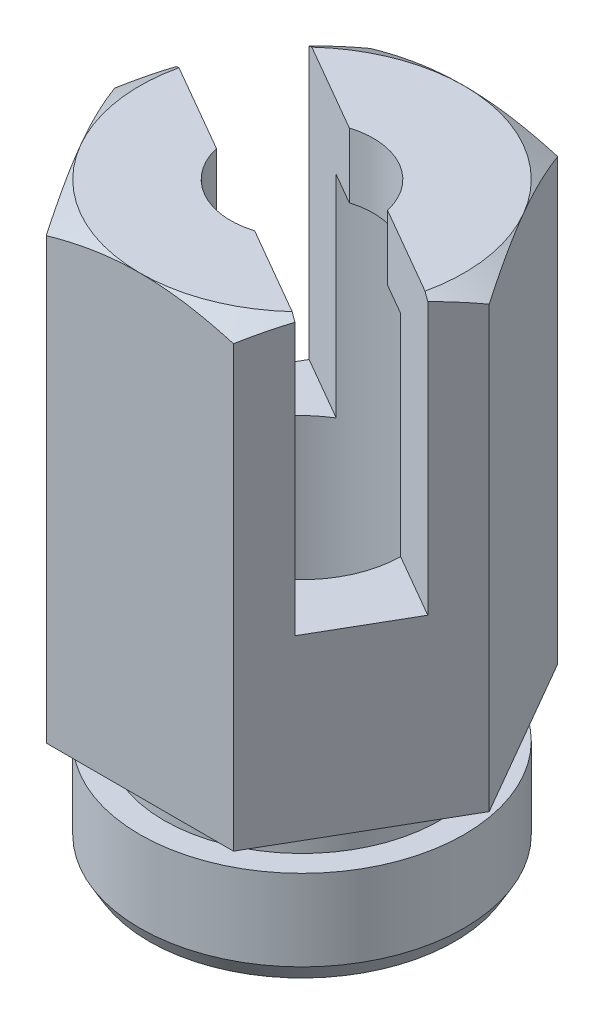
ISO-10303-21;
HEADER;
FILE_DESCRIPTION(('STEP AP214'),'2;1');
FILE_NAME('part.step','',(''),(''),'','','');
FILE_SCHEMA(('AUTOMOTIVE_DESIGN { 1 0 10303 214 1 1 1 1 }'));
ENDSEC;
DATA;
#1=APPLICATION_CONTEXT('core data for automotive mechanical design processes');
#2=APPLICATION_PROTOCOL_DEFINITION('international standard','automotive_design',2000,#1);
#3=PRODUCT_CONTEXT('',#1,'mechanical');
#4=PRODUCT('Part','Part','',(#3));
#5=PRODUCT_RELATED_PRODUCT_CATEGORY('part','',(#4));
#6=PRODUCT_DEFINITION_FORMATION('','',#4);
#7=PRODUCT_DEFINITION_CONTEXT('part definition',#1,'design');
#8=PRODUCT_DEFINITION('design','',#6,#7);
#9=PRODUCT_DEFINITION_SHAPE('','',#8);
#10=(LENGTH_UNIT() NAMED_UNIT(*) SI_UNIT(.MILLI.,.METRE.));
#11=(NAMED_UNIT(*) PLANE_ANGLE_UNIT() SI_UNIT($,.RADIAN.));
#12=(NAMED_UNIT(*) SI_UNIT($,.STERADIAN.) SOLID_ANGLE_UNIT());
#13=UNCERTAINTY_MEASURE_WITH_UNIT(LENGTH_MEASURE(1.E-05),#10,'distance_accuracy_value','');
#14=(GEOMETRIC_REPRESENTATION_CONTEXT(3) GLOBAL_UNCERTAINTY_ASSIGNED_CONTEXT((#13)) GLOBAL_UNIT_ASSIGNED_CONTEXT((#10,
#11,#12)) REPRESENTATION_CONTEXT('',''));
#15=CARTESIAN_POINT('',(0.,0.,0.));
#16=DIRECTION('',(0.,0.,1.));
#17=DIRECTION('',(1.,0.,0.));
#18=AXIS2_PLACEMENT_3D('',#15,#16,#17);
#19=CARTESIAN_POINT('',(-7.24519052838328,14.,-2.45096189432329));
#20=DIRECTION('',(-0.499999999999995,0.,0.866025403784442));
#21=DIRECTION('',(0.866025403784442,0.,0.499999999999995));
#22=AXIS2_PLACEMENT_3D('',#19,#20,#21);
#23=PLANE('',#22);
#24=DIRECTION('',(-0.866025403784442,0.,-0.499999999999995));
#25=VECTOR('',#24,1.);
#26=CARTESIAN_POINT('',(-0.749999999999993,12.,1.29903810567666));
#27=LINE('',#26,#25);
#28=CARTESIAN_POINT('',(1.59946802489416,12.,2.6555041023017));
#29=VERTEX_POINT('',#28);
#30=CARTESIAN_POINT('',(0.643735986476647,12.,2.10371195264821));
#31=VERTEX_POINT('',#30);
#32=EDGE_CURVE('E197',#29,#31,#27,.T.);
#33=ORIENTED_EDGE('',*,*,#32,.T.);
#34=DIRECTION('',(0.,1.,0.));
#35=VECTOR('',#34,1.);
#36=CARTESIAN_POINT('',(0.643735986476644,-4.,2.10371195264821));
#37=LINE('',#36,#35);
#38=CARTESIAN_POINT('',(0.643735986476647,14.,2.10371195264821));
#39=VERTEX_POINT('',#38);
#40=EDGE_CURVE('E184',#31,#39,#37,.T.);
#41=ORIENTED_EDGE('',*,*,#40,.T.);
#42=DIRECTION('',(0.866025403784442,0.,0.499999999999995));
#43=VECTOR('',#42,1.);
#44=CARTESIAN_POINT('',(-7.24519052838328,14.,-2.45096189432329));
#45=LINE('',#44,#43);
#46=CARTESIAN_POINT('',(3.38067791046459,14.,3.683886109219));
#47=VERTEX_POINT('',#46);
#48=EDGE_CURVE('E194',#39,#47,#45,.T.);
#49=ORIENTED_EDGE('',*,*,#48,.T.);
#50=CARTESIAN_POINT('',(-2.34730853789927,15.5141796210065,0.376831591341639));
#51=CARTESIAN_POINT('',(-2.30079289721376,15.5382316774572,0.403687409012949));
#52=CARTESIAN_POINT('',(-2.25414428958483,15.5619468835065,0.430619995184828));
#53=CARTESIAN_POINT('',(-2.16052429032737,15.608541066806,0.484671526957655));
#54=CARTESIAN_POINT('',(-2.11355283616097,15.6314198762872,0.511790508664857));
#55=CARTESIAN_POINT('',(-2.01903264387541,15.6762715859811,0.566361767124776));
#56=CARTESIAN_POINT('',(-1.97148224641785,15.6982398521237,0.593815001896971));
#57=CARTESIAN_POINT('',(-1.87596681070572,15.7409280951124,0.648960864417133));
#58=CARTESIAN_POINT('',(-1.82800179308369,15.7616481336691,0.6766534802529));
#59=CARTESIAN_POINT('',(-1.6834764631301,15.8215133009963,0.760095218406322));
#60=CARTESIAN_POINT('',(-1.58619769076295,15.8584063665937,0.81625914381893));
#61=CARTESIAN_POINT('',(-1.38948829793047,15.9231515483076,0.929829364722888));
#62=CARTESIAN_POINT('',(-1.29006155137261,15.951018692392,0.987233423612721));
#63=CARTESIAN_POINT('',(-1.11626093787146,15.9881510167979,1.08757725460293));
#64=CARTESIAN_POINT('',(-1.04237740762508,16.000408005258,1.13023393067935));
#65=CARTESIAN_POINT('',(-0.893933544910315,16.0167895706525,1.21593803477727));
#66=CARTESIAN_POINT('',(-0.819373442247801,16.0209168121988,1.25898533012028));
#67=CARTESIAN_POINT('',(-0.670746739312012,16.0205225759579,1.34479499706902));
#68=CARTESIAN_POINT('',(-0.596680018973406,16.0160559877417,1.38755743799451));
#69=CARTESIAN_POINT('',(-0.449238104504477,15.9991406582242,1.47268306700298));
#70=CARTESIAN_POINT('',(-0.375863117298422,15.9866896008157,1.51504613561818));
#71=CARTESIAN_POINT('',(-0.224432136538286,15.9538511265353,1.60247485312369));
#72=CARTESIAN_POINT('',(-0.146468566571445,15.9329107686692,1.64748714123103));
#73=CARTESIAN_POINT('',(0.0080872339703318,15.8850862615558,1.73671997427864));
#74=CARTESIAN_POINT('',(0.0846787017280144,15.858198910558,1.78094007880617));
#75=CARTESIAN_POINT('',(0.236793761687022,15.7999880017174,1.8687637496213));
#76=CARTESIAN_POINT('',(0.312313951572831,15.768652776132,1.91236535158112));
#77=CARTESIAN_POINT('',(0.462273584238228,15.7027978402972,1.99894458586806));
#78=CARTESIAN_POINT('',(0.536713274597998,15.6682788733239,2.04192236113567));
#79=CARTESIAN_POINT('',(0.686870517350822,15.5958718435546,2.12861568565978));
#80=CARTESIAN_POINT('',(0.76256316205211,15.5579153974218,2.17231685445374));
#81=CARTESIAN_POINT('',(0.913236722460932,15.4801649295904,2.25930827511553));
#82=CARTESIAN_POINT('',(0.988217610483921,15.4403708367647,2.30259851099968));
#83=CARTESIAN_POINT('',(1.21206798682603,15.3190780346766,2.431838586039));
#84=CARTESIAN_POINT('',(1.36010571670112,15.2355390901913,2.5173082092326));
#85=CARTESIAN_POINT('',(1.70424594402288,15.0366807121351,2.7159976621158));
#86=CARTESIAN_POINT('',(1.89979912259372,14.920107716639,2.82890034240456));
#87=CARTESIAN_POINT('',(2.2894681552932,14.6837820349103,3.05387586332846));
#88=CARTESIAN_POINT('',(2.48358390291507,14.5640291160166,3.16594864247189));
#89=CARTESIAN_POINT('',(2.87106534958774,14.322474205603,3.38966116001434));
#90=CARTESIAN_POINT('',(3.06443027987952,14.2006705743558,3.50130045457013));
#91=CARTESIAN_POINT('',(3.45054915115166,13.9557986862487,3.72422628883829));
#92=CARTESIAN_POINT('',(3.6433031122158,13.8327304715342,3.83551284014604));
#93=CARTESIAN_POINT('',(4.01073159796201,13.5970499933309,4.04764777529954));
#94=CARTESIAN_POINT('',(4.18544285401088,13.4845140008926,4.14851736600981));
#95=CARTESIAN_POINT('',(4.53461020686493,13.2589109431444,4.35010923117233));
#96=CARTESIAN_POINT('',(4.7090663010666,13.1458438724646,4.45083150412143));
#97=CARTESIAN_POINT('',(5.05759484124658,12.9194336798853,4.65205455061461));
#98=CARTESIAN_POINT('',(5.23166749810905,12.8060909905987,4.75255544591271));
#99=CARTESIAN_POINT('',(5.57965734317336,12.579093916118,4.95346747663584));
#100=CARTESIAN_POINT('',(5.75357453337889,12.4654395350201,5.05387861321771));
#101=CARTESIAN_POINT('',(5.92743555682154,12.3516710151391,5.1542573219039));
#102=B_SPLINE_CURVE_WITH_KNOTS('',3,(#50,#51,#52,#53,#54,#55,#56,#57,#58,#59,#60,#61,#62,#63,
#64,#65,#66,#67,#68,#69,#70,#71,#72,#73,#74,#75,#76,#77,#78,#79,#80,#81,#82,#83,#84,#85,#86,#87,
#88,#89,#90,#91,#92,#93,#94,#95,#96,#97,#98,#99,#100,#101),.UNSPECIFIED.,.F.,.F.,(4,2,2,2,2,2,2,
2,2,2,2,2,2,2,2,2,2,2,2,2,2,2,2,2,2,4),(0.,0.176555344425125,0.35314591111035,0.530546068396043,
0.707937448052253,1.06238910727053,1.41624754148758,1.67448512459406,1.932638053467,
2.18914760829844,2.4457316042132,2.72274393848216,2.99990577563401,3.27780858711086,
3.55564668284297,3.84148345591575,4.12733130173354,4.69804471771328,5.46036469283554,
6.22274059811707,6.98575813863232,7.74875033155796,8.44176262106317,9.13478193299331,
9.82704932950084,10.5193076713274),.UNSPECIFIED.);
#103=CARTESIAN_POINT('',(3.58012701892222,13.8728944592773,3.79903810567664));
#104=VERTEX_POINT('',#103);
#105=EDGE_CURVE('E266',#47,#104,#102,.T.);
#106=ORIENTED_EDGE('',*,*,#105,.T.);
#107=DIRECTION('',(0.,-1.,0.));
#108=VECTOR('',#107,1.);
#109=CARTESIAN_POINT('',(3.58012701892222,14.,3.79903810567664));
#110=LINE('',#109,#108);
#111=CARTESIAN_POINT('',(3.58012701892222,5.5,3.79903810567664));
#112=VERTEX_POINT('',#111);
#113=EDGE_CURVE('E198',#104,#112,#110,.T.);
#114=ORIENTED_EDGE('',*,*,#113,.T.);
#115=DIRECTION('',(0.866025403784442,0.,0.499999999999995));
#116=VECTOR('',#115,1.);
#117=CARTESIAN_POINT('',(-7.24519052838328,5.5,-2.45096189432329));
#118=LINE('',#117,#116);
#119=CARTESIAN_POINT('',(1.59946802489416,5.5,2.6555041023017));
#120=VERTEX_POINT('',#119);
#121=EDGE_CURVE('E219',#120,#112,#118,.T.);
#122=ORIENTED_EDGE('',*,*,#121,.F.);
#123=DIRECTION('',(0.,-1.,0.));
#124=VECTOR('',#123,1.);
#125=CARTESIAN_POINT('',(1.59946802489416,12.,2.6555041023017));
#126=LINE('',#125,#124);
#127=EDGE_CURVE('E492',#29,#120,#126,.T.);
#128=ORIENTED_EDGE('',*,*,#127,.F.);
#129=EDGE_LOOP('',(#33,#41,#49,#106,#114,#122,#128));
#130=FACE_BOUND('',#129,.T.);
#131=ADVANCED_FACE('F34',(#130),#23,.F.);
#132=CARTESIAN_POINT('',(-5.7451905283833,14.,-5.04903810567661));
#133=DIRECTION('',(0.499999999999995,0.,-0.866025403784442));
#134=DIRECTION('',(-0.866025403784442,0.,-0.499999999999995));
#135=AXIS2_PLACEMENT_3D('',#132,#133,#134);
#136=PLANE('',#135);
#137=DIRECTION('',(0.866025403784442,0.,0.499999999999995));
#138=VECTOR('',#137,1.);
#139=CARTESIAN_POINT('',(0.749999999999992,12.,-1.29903810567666));
#140=LINE('',#139,#138);
#141=CARTESIAN_POINT('',(-1.59946802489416,12.,-2.6555041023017));
#142=VERTEX_POINT('',#141);
#143=CARTESIAN_POINT('',(-0.643735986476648,12.,-2.10371195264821));
#144=VERTEX_POINT('',#143);
#145=EDGE_CURVE('E387',#142,#144,#140,.T.);
#146=ORIENTED_EDGE('',*,*,#145,.T.);
#147=DIRECTION('',(0.,1.,0.));
#148=VECTOR('',#147,1.);
#149=CARTESIAN_POINT('',(-0.643735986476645,-4.,-2.10371195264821));
#150=LINE('',#149,#148);
#151=CARTESIAN_POINT('',(-0.643735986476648,14.,-2.10371195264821));
#152=VERTEX_POINT('',#151);
#153=EDGE_CURVE('E11',#144,#152,#150,.T.);
#154=ORIENTED_EDGE('',*,*,#153,.T.);
#155=DIRECTION('',(0.866025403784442,0.,0.499999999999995));
#156=VECTOR('',#155,1.);
#157=CARTESIAN_POINT('',(-5.7451905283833,14.,-5.04903810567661));
#158=LINE('',#157,#156);
#159=CARTESIAN_POINT('',(-3.38067791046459,14.,-3.683886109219));
#160=VERTEX_POINT('',#159);
#161=EDGE_CURVE('E205',#160,#152,#158,.T.);
#162=ORIENTED_EDGE('',*,*,#161,.F.);
#163=CARTESIAN_POINT('',(3.04768865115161,15.1270956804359,0.0275330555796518));
#164=CARTESIAN_POINT('',(2.99306879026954,15.1587903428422,-0.00400173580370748));
#165=CARTESIAN_POINT('',(2.93835579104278,15.1902722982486,-0.035590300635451));
#166=CARTESIAN_POINT('',(2.82870393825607,15.2527116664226,-0.0988978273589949));
#167=CARTESIAN_POINT('',(2.77376507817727,15.2836690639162,-0.130616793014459));
#168=CARTESIAN_POINT('',(2.60834286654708,15.3757210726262,-0.226123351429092));
#169=CARTESIAN_POINT('',(2.49746409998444,15.4358725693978,-0.29013923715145));
#170=CARTESIAN_POINT('',(2.26860115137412,15.5553716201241,-0.422273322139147));
#171=CARTESIAN_POINT('',(2.15054011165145,15.6145265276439,-0.490435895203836));
#172=CARTESIAN_POINT('',(1.97171271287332,15.6982307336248,-0.593681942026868));
#173=CARTESIAN_POINT('',(1.9118303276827,15.7252876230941,-0.628255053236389));
#174=CARTESIAN_POINT('',(1.79136699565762,15.7772310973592,-0.697804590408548));
#175=CARTESIAN_POINT('',(1.73078612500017,15.8021179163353,-0.732780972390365));
#176=CARTESIAN_POINT('',(1.59527764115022,15.8543233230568,-0.811016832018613));
#177=CARTESIAN_POINT('',(1.52014852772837,15.8809567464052,-0.854392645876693));
#178=CARTESIAN_POINT('',(1.36857820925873,15.9285860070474,-0.941901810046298));
#179=CARTESIAN_POINT('',(1.29213779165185,15.9495851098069,-0.986034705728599));
#180=CARTESIAN_POINT('',(1.1393827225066,15.9839021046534,-1.07422788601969));
#181=CARTESIAN_POINT('',(1.06309121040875,15.9973531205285,-1.11827481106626));
#182=CARTESIAN_POINT('',(0.909737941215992,16.0156487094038,-1.20681336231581));
#183=CARTESIAN_POINT('',(0.832676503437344,16.0204967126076,-1.25130480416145));
#184=CARTESIAN_POINT('',(0.67774607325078,16.0209413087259,-1.34075392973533));
#185=CARTESIAN_POINT('',(0.599876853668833,16.0164431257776,-1.38571174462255));
#186=CARTESIAN_POINT('',(0.44490398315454,15.9986228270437,-1.47518537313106));
#187=CARTESIAN_POINT('',(0.367800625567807,15.9852974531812,-1.51970101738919));
#188=CARTESIAN_POINT('',(0.213864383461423,15.9511377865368,-1.60857614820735));
#189=CARTESIAN_POINT('',(0.13704755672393,15.9302096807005,-1.65292636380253));
#190=CARTESIAN_POINT('',(0.0228556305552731,15.894535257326,-1.71885510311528));
#191=CARTESIAN_POINT('',(-0.0150397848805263,15.881928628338,-1.7407340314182));
#192=CARTESIAN_POINT('',(-0.0905047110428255,15.855480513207,-1.78430372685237));
#193=CARTESIAN_POINT('',(-0.128074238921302,15.8416390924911,-1.80599450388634));
#194=CARTESIAN_POINT('',(-0.241837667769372,15.7979525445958,-1.87167585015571));
#195=CARTESIAN_POINT('',(-0.317550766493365,15.7664392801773,-1.91538882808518));
#196=CARTESIAN_POINT('',(-0.467929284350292,15.7002215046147,-2.00220990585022));
#197=CARTESIAN_POINT('',(-0.542594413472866,15.6655161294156,-2.04531783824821));
#198=CARTESIAN_POINT('',(-0.691135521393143,15.5937356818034,-2.13107808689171));
#199=CARTESIAN_POINT('',(-0.765010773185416,15.5566586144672,-2.17372998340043));
#200=CARTESIAN_POINT('',(-0.912085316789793,15.4807528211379,-2.25864351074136));
#201=CARTESIAN_POINT('',(-0.985284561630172,15.4419239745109,-2.30090511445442));
#202=CARTESIAN_POINT('',(-1.20445907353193,15.3232708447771,-2.42744557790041));
#203=CARTESIAN_POINT('',(-1.34962973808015,15.2414699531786,-2.51125990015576));
#204=CARTESIAN_POINT('',(-1.6385223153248,15.0747692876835,-2.67805210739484));
#205=CARTESIAN_POINT('',(-1.78224492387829,14.9898711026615,-2.76103039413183));
#206=CARTESIAN_POINT('',(-2.06914226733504,14.8178140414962,-2.92667065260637));
#207=CARTESIAN_POINT('',(-2.21231462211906,14.7306498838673,-3.00933125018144));
#208=CARTESIAN_POINT('',(-2.49803425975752,14.5549216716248,-3.17429155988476));
#209=CARTESIAN_POINT('',(-2.64058146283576,14.4663574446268,-3.25659122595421));
#210=CARTESIAN_POINT('',(-3.06708652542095,14.199505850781,-3.50283403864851));
#211=CARTESIAN_POINT('',(-3.35036826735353,14.0197795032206,-3.66638682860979));
#212=CARTESIAN_POINT('',(-3.94797673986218,13.637776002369,-4.01141624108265));
#213=CARTESIAN_POINT('',(-4.26218414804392,13.4352511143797,-4.19282397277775));
#214=CARTESIAN_POINT('',(-4.89004132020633,13.0285956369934,-4.55531748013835));
#215=CARTESIAN_POINT('',(-5.20369069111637,12.8244642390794,-4.73640302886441));
#216=CARTESIAN_POINT('',(-5.82767333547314,12.4171353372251,-5.09665957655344));
#217=CARTESIAN_POINT('',(-6.13801075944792,12.2139463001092,-5.2758329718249));
#218=CARTESIAN_POINT('',(-6.75820026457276,11.8070435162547,-5.6338995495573));
#219=CARTESIAN_POINT('',(-7.06805251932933,11.60333012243,-5.81279283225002));
#220=CARTESIAN_POINT('',(-7.37781567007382,11.3994371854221,-5.99163467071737));
#221=B_SPLINE_CURVE_WITH_KNOTS('',3,(#163,#164,#165,#166,#167,#168,#169,#170,#171,#172,#173,
#174,#175,#176,#177,#178,#179,#180,#181,#182,#183,#184,#185,#186,#187,#188,#189,#190,#191,#192,
#193,#194,#195,#196,#197,#198,#199,#200,#201,#202,#203,#204,#205,#206,#207,#208,#209,#210,#211,
#212,#213,#214,#215,#216,#217,#218,#219,#220),.UNSPECIFIED.,.F.,.F.,(4,2,2,2,2,2,2,2,2,2,2,2,2,
2,2,2,2,2,2,2,2,2,2,2,2,2,2,2,4),(0.,0.211757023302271,0.423520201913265,0.847862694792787,
1.29355081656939,1.51627718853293,1.73897949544,2.01108280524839,2.2830280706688,
2.55001286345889,2.81689117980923,3.08648900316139,3.35618638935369,3.62933146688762,
3.76593075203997,3.90252280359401,4.18122223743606,4.45999733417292,4.73901008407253,
5.01804207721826,5.57754413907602,6.13676311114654,6.69742917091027,7.25816480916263,
8.37783348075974,9.62436949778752,10.8715790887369,12.1074117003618,13.3425598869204),.UNSPECIFIED.);
#222=CARTESIAN_POINT('',(-3.58012701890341,13.8728944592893,-3.79903810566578));
#223=VERTEX_POINT('',#222);
#224=EDGE_CURVE('E234',#160,#223,#221,.T.);
#225=ORIENTED_EDGE('',*,*,#224,.T.);
#226=DIRECTION('',(0.,1.,0.));
#227=VECTOR('',#226,1.);
#228=CARTESIAN_POINT('',(-3.5801270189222,14.,-3.79903810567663));
#229=LINE('',#228,#227);
#230=CARTESIAN_POINT('',(-3.5801270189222,5.5,-3.79903810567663));
#231=VERTEX_POINT('',#230);
#232=EDGE_CURVE('E414',#231,#223,#229,.T.);
#233=ORIENTED_EDGE('',*,*,#232,.F.);
#234=DIRECTION('',(0.866025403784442,0.,0.499999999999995));
#235=VECTOR('',#234,1.);
#236=CARTESIAN_POINT('',(-5.7451905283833,5.5,-5.04903810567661));
#237=LINE('',#236,#235);
#238=CARTESIAN_POINT('',(-1.59946802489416,5.5,-2.6555041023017));
#239=VERTEX_POINT('',#238);
#240=EDGE_CURVE('E217',#231,#239,#237,.T.);
#241=ORIENTED_EDGE('',*,*,#240,.T.);
#242=DIRECTION('',(0.,-1.,0.));
#243=VECTOR('',#242,1.);
#244=CARTESIAN_POINT('',(-1.59946802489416,12.,-2.6555041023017));
#245=LINE('',#244,#243);
#246=EDGE_CURVE('E207',#142,#239,#245,.T.);
#247=ORIENTED_EDGE('',*,*,#246,.F.);
#248=EDGE_LOOP('',(#146,#154,#162,#225,#233,#241,#247));
#249=FACE_BOUND('',#248,.T.);
#250=ADVANCED_FACE('F251',(#249),#136,.F.);
#251=CARTESIAN_POINT('',(0.,14.,0.));
#252=DIRECTION('',(0.,1.,0.));
#253=DIRECTION('',(0.,0.,1.));
#254=AXIS2_PLACEMENT_3D('',#251,#252,#253);
#255=PLANE('',#254);
#256=CARTESIAN_POINT('',(0.,14.,0.));
#257=DIRECTION('',(0.,1.,0.));
#258=DIRECTION('',(0.,0.,1.));
#259=AXIS2_PLACEMENT_3D('',#256,#257,#258);
#260=CIRCLE('',#259,2.2);
#261=CARTESIAN_POINT('',(-2.14373598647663,14.,0.494364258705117));
#262=VERTEX_POINT('',#261);
#263=EDGE_CURVE('E181',#262,#39,#260,.T.);
#264=ORIENTED_EDGE('',*,*,#263,.F.);
#265=CARTESIAN_POINT('',(-4.88067791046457,14.,-1.08580989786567));
#266=VERTEX_POINT('',#265);
#267=EDGE_CURVE('E204',#266,#262,#45,.T.);
#268=ORIENTED_EDGE('',*,*,#267,.F.);
#269=CARTESIAN_POINT('',(0.,14.,0.));
#270=DIRECTION('',(0.,1.,0.));
#271=DIRECTION('',(0.,0.,1.));
#272=AXIS2_PLACEMENT_3D('',#269,#270,#271);
#273=CIRCLE('',#272,4.99999999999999);
#274=CARTESIAN_POINT('',(-4.33012701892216,14.,2.50000000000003));
#275=VERTEX_POINT('',#274);
#276=EDGE_CURVE('E431',#266,#275,#273,.T.);
#277=ORIENTED_EDGE('',*,*,#276,.T.);
#278=CARTESIAN_POINT('',(0.,14.,4.99999999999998));
#279=VERTEX_POINT('',#278);
#280=EDGE_CURVE('E436',#275,#279,#273,.T.);
#281=ORIENTED_EDGE('',*,*,#280,.T.);
#282=CARTESIAN_POINT('',(0.,14.,0.));
#283=DIRECTION('',(0.,1.,0.));
#284=DIRECTION('',(0.,0.,1.));
#285=AXIS2_PLACEMENT_3D('',#282,#283,#284);
#286=CIRCLE('',#285,4.99999999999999);
#287=EDGE_CURVE('E203',#279,#47,#286,.T.);
#288=ORIENTED_EDGE('',*,*,#287,.T.);
#289=ORIENTED_EDGE('',*,*,#48,.F.);
#290=EDGE_LOOP('',(#264,#268,#277,#281,#288,#289));
#291=FACE_BOUND('',#290,.T.);
#292=ADVANCED_FACE('F201',(#291),#255,.T.);
#293=CARTESIAN_POINT('',(0.,12.,0.));
#294=DIRECTION('',(0.,-1.,0.));
#295=DIRECTION('',(0.,0.,-1.));
#296=AXIS2_PLACEMENT_3D('',#293,#294,#295);
#297=PLANE('',#296);
#298=CARTESIAN_POINT('',(0.,12.,0.));
#299=DIRECTION('',(0.,-1.,0.));
#300=DIRECTION('',(0.,0.,-1.));
#301=AXIS2_PLACEMENT_3D('',#298,#299,#300);
#302=CIRCLE('',#301,2.2);
#303=CARTESIAN_POINT('',(-2.14373598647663,12.,0.494364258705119));
#304=VERTEX_POINT('',#303);
#305=EDGE_CURVE('E49',#31,#304,#302,.T.);
#306=ORIENTED_EDGE('',*,*,#305,.F.);
#307=ORIENTED_EDGE('',*,*,#32,.F.);
#308=CARTESIAN_POINT('',(0.,12.,0.));
#309=DIRECTION('',(0.,-1.,0.));
#310=DIRECTION('',(0.,0.,-1.));
#311=AXIS2_PLACEMENT_3D('',#308,#309,#310);
#312=CIRCLE('',#311,3.1);
#313=CARTESIAN_POINT('',(-3.09946802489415,12.,-0.0574278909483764));
#314=VERTEX_POINT('',#313);
#315=EDGE_CURVE('E286',#29,#314,#312,.T.);
#316=ORIENTED_EDGE('',*,*,#315,.T.);
#317=EDGE_CURVE('E391',#304,#314,#27,.T.);
#318=ORIENTED_EDGE('',*,*,#317,.F.);
#319=EDGE_LOOP('',(#306,#307,#316,#318));
#320=FACE_BOUND('',#319,.T.);
#321=ADVANCED_FACE('F383',(#320),#297,.T.);
#322=CARTESIAN_POINT('',(0.,0.,0.));
#323=DIRECTION('',(0.,1.,0.));
#324=DIRECTION('',(0.,0.,1.));
#325=AXIS2_PLACEMENT_3D('',#322,#323,#324);
#326=PLANE('',#325);
#327=DIRECTION('',(0.499999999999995,0.,-0.866025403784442));
#328=VECTOR('',#327,1.);
#329=CARTESIAN_POINT('',(2.88675134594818,0.,4.99999999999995));
#330=LINE('',#329,#328);
#331=CARTESIAN_POINT('',(2.88675134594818,0.,4.99999999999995));
#332=VERTEX_POINT('',#331);
#333=CARTESIAN_POINT('',(5.77350269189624,0.,0.));
#334=VERTEX_POINT('',#333);
#335=EDGE_CURVE('E471',#332,#334,#330,.T.);
#336=ORIENTED_EDGE('',*,*,#335,.F.);
#337=DIRECTION('',(1.,0.,0.));
#338=VECTOR('',#337,1.);
#339=CARTESIAN_POINT('',(-2.88675134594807,0.,5.00000000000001));
#340=LINE('',#339,#338);
#341=CARTESIAN_POINT('',(-2.88675134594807,0.,5.00000000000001));
#342=VERTEX_POINT('',#341);
#343=EDGE_CURVE('E458',#342,#332,#340,.T.);
#344=ORIENTED_EDGE('',*,*,#343,.F.);
#345=DIRECTION('',(0.500000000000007,0.,0.866025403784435));
#346=VECTOR('',#345,1.);
#347=CARTESIAN_POINT('',(-5.77350269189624,0.,0.));
#348=LINE('',#347,#346);
#349=CARTESIAN_POINT('',(-5.77350269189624,0.,0.));
#350=VERTEX_POINT('',#349);
#351=EDGE_CURVE('E461',#350,#342,#348,.T.);
#352=ORIENTED_EDGE('',*,*,#351,.F.);
#353=DIRECTION('',(-0.499999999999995,0.,0.866025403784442));
#354=VECTOR('',#353,1.);
#355=CARTESIAN_POINT('',(-2.88675134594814,0.,-4.99999999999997));
#356=LINE('',#355,#354);
#357=CARTESIAN_POINT('',(-2.88675134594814,0.,-4.99999999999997));
#358=VERTEX_POINT('',#357);
#359=EDGE_CURVE('E464',#358,#350,#356,.T.);
#360=ORIENTED_EDGE('',*,*,#359,.F.);
#361=DIRECTION('',(-1.,0.,0.));
#362=VECTOR('',#361,1.);
#363=CARTESIAN_POINT('',(2.88675134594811,0.,-4.99999999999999));
#364=LINE('',#363,#362);
#365=CARTESIAN_POINT('',(2.88675134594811,0.,-4.99999999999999));
#366=VERTEX_POINT('',#365);
#367=EDGE_CURVE('E467',#366,#358,#364,.T.);
#368=ORIENTED_EDGE('',*,*,#367,.F.);
#369=DIRECTION('',(-0.500000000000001,0.,-0.866025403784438));
#370=VECTOR('',#369,1.);
#371=CARTESIAN_POINT('',(5.77350269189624,0.,0.));
#372=LINE('',#371,#370);
#373=EDGE_CURVE('E470',#334,#366,#372,.T.);
#374=ORIENTED_EDGE('',*,*,#373,.F.);
#375=EDGE_LOOP('',(#336,#344,#352,#360,#368,#374));
#376=FACE_BOUND('',#375,.T.);
#377=CARTESIAN_POINT('',(0.,0.,0.));
#378=DIRECTION('',(0.,1.,0.));
#379=DIRECTION('',(0.,0.,1.));
#380=AXIS2_PLACEMENT_3D('',#377,#378,#379);
#381=CIRCLE('',#380,4.25);
#382=CARTESIAN_POINT('',(0.,0.,4.25));
#383=VERTEX_POINT('',#382);
#384=EDGE_CURVE('E428',#383,#383,#381,.F.);
#385=ORIENTED_EDGE('',*,*,#384,.F.);
#386=EDGE_LOOP('',(#385));
#387=FACE_BOUND('',#386,.T.);
#388=ADVANCED_FACE('F314',(#376,#387),#326,.F.);
#389=CARTESIAN_POINT('',(2.88675134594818,14.,4.99999999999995));
#390=DIRECTION('',(-0.866025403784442,0.,-0.499999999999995));
#391=DIRECTION('',(-0.499999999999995,0.,0.866025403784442));
#392=AXIS2_PLACEMENT_3D('',#389,#390,#391);
#393=PLANE('',#392);
#394=DIRECTION('',(0.499999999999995,0.,-0.866025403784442));
#395=VECTOR('',#394,1.);
#396=CARTESIAN_POINT('',(3.58012701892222,5.5,3.79903810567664));
#397=LINE('',#396,#395);
#398=CARTESIAN_POINT('',(5.0801270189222,5.5,1.20096189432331));
#399=VERTEX_POINT('',#398);
#400=EDGE_CURVE('E483',#112,#399,#397,.T.);
#401=ORIENTED_EDGE('',*,*,#400,.F.);
#402=ORIENTED_EDGE('',*,*,#113,.F.);
#403=CARTESIAN_POINT('',(2.88663587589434,13.5533513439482,5.00019999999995));
#404=CARTESIAN_POINT('',(3.01349970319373,13.6266134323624,4.78046540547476));
#405=CARTESIAN_POINT('',(3.14144859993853,13.6932486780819,4.55885141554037));
#406=CARTESIAN_POINT('',(3.39956193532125,13.8095610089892,4.11178600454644));
#407=CARTESIAN_POINT('',(3.52973095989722,13.8591969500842,3.88632664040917));
#408=CARTESIAN_POINT('',(3.78847564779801,13.9364489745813,3.43816769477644));
#409=CARTESIAN_POINT('',(3.91701101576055,13.9645796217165,3.21553790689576));
#410=CARTESIAN_POINT('',(4.11026620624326,13.9898050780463,2.88081009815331));
#411=CARTESIAN_POINT('',(4.17472868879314,13.9953865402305,2.76915780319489));
#412=CARTESIAN_POINT('',(4.30371322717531,14.0007977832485,2.54575002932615));
#413=CARTESIAN_POINT('',(4.36823528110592,14.0006277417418,2.43399455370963));
#414=CARTESIAN_POINT('',(4.54500768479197,13.992246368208,2.12781576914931));
#415=CARTESIAN_POINT('',(4.65719946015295,13.9781702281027,1.93349391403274));
#416=CARTESIAN_POINT('',(4.88083840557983,13.9335347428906,1.54613989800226));
#417=CARTESIAN_POINT('',(4.99228478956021,13.9029601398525,1.3531090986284));
#418=CARTESIAN_POINT('',(5.21637431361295,13.8265315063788,0.964974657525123));
#419=CARTESIAN_POINT('',(5.32898917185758,13.7803536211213,0.769920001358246));
#420=CARTESIAN_POINT('',(5.55253939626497,13.6755482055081,0.382719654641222));
#421=CARTESIAN_POINT('',(5.6634776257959,13.6169452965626,0.190569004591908));
#422=CARTESIAN_POINT('',(5.77361816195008,13.5533513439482,-0.000200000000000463));
#423=B_SPLINE_CURVE_WITH_KNOTS('',3,(#403,#404,#405,#406,#407,#408,#409,#410,#411,#412,#413,
#414,#415,#416,#417,#418,#419,#420,#421,#422),.UNSPECIFIED.,.F.,.F.,(4,2,2,2,2,2,2,2,2,4),(0.,
0.792555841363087,1.58701660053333,2.3618153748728,2.74884076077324,3.13585419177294,
3.80962362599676,4.48401723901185,5.17336882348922,5.86136694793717),.UNSPECIFIED.);
#424=CARTESIAN_POINT('',(2.88675134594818,13.5534180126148,4.99999999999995));
#425=VERTEX_POINT('',#424);
#426=EDGE_CURVE('E473',#425,#104,#423,.T.);
#427=ORIENTED_EDGE('',*,*,#426,.F.);
#428=DIRECTION('',(0.,-1.,0.));
#429=VECTOR('',#428,1.);
#430=CARTESIAN_POINT('',(2.88675134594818,14.,4.99999999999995));
#431=LINE('',#430,#429);
#432=EDGE_CURVE('E456',#425,#332,#431,.T.);
#433=ORIENTED_EDGE('',*,*,#432,.T.);
#434=ORIENTED_EDGE('',*,*,#335,.T.);
#435=DIRECTION('',(0.,-1.,0.));
#436=VECTOR('',#435,1.);
#437=CARTESIAN_POINT('',(5.77350269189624,14.,0.));
#438=LINE('',#437,#436);
#439=CARTESIAN_POINT('',(5.77350269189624,13.5534180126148,0.));
#440=VERTEX_POINT('',#439);
#441=EDGE_CURVE('E441',#440,#334,#438,.T.);
#442=ORIENTED_EDGE('',*,*,#441,.F.);
#443=CARTESIAN_POINT('',(5.0801270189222,13.8728944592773,1.20096189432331));
#444=VERTEX_POINT('',#443);
#445=EDGE_CURVE('E346',#444,#440,#423,.T.);
#446=ORIENTED_EDGE('',*,*,#445,.F.);
#447=DIRECTION('',(0.,1.,0.));
#448=VECTOR('',#447,1.);
#449=CARTESIAN_POINT('',(5.0801270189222,14.,1.20096189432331));
#450=LINE('',#449,#448);
#451=EDGE_CURVE('E212',#399,#444,#450,.T.);
#452=ORIENTED_EDGE('',*,*,#451,.F.);
#453=EDGE_LOOP('',(#401,#402,#427,#433,#434,#442,#446,#452));
#454=FACE_BOUND('',#453,.T.);
#455=ADVANCED_FACE('F355',(#454),#393,.F.);
#456=CARTESIAN_POINT('',(5.77350269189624,14.,0.));
#457=DIRECTION('',(-0.866025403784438,0.,0.500000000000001));
#458=DIRECTION('',(0.500000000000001,0.,0.866025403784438));
#459=AXIS2_PLACEMENT_3D('',#456,#457,#458);
#460=PLANE('',#459);
#461=CARTESIAN_POINT('',(5.77361816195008,13.5533513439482,0.000200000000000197));
#462=CARTESIAN_POINT('',(5.64675433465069,13.6266134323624,-0.219534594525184));
#463=CARTESIAN_POINT('',(5.51880543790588,13.6932486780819,-0.441148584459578));
#464=CARTESIAN_POINT('',(5.26069210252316,13.8095610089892,-0.888213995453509));
#465=CARTESIAN_POINT('',(5.13052307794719,13.8591969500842,-1.11367335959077));
#466=CARTESIAN_POINT('',(4.87177839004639,13.9364489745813,-1.5618323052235));
#467=CARTESIAN_POINT('',(4.74324302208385,13.9645796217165,-1.78446209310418));
#468=CARTESIAN_POINT('',(4.54998783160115,13.9898050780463,-2.11918990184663));
#469=CARTESIAN_POINT('',(4.48552534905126,13.9953865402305,-2.23084219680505));
#470=CARTESIAN_POINT('',(4.35654081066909,14.0007977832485,-2.45424997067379));
#471=CARTESIAN_POINT('',(4.29201875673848,14.0006277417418,-2.5660054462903));
#472=CARTESIAN_POINT('',(4.11524635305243,13.992246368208,-2.87218423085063));
#473=CARTESIAN_POINT('',(4.00305457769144,13.9781702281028,-3.0665060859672));
#474=CARTESIAN_POINT('',(3.77941563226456,13.9335347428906,-3.45386010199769));
#475=CARTESIAN_POINT('',(3.66796924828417,13.9029601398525,-3.64689090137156));
#476=CARTESIAN_POINT('',(3.44387972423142,13.8265315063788,-4.03502534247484));
#477=CARTESIAN_POINT('',(3.33126486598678,13.7803536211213,-4.23007999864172));
#478=CARTESIAN_POINT('',(3.10771464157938,13.6755482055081,-4.61728034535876));
#479=CARTESIAN_POINT('',(2.99677641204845,13.6169452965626,-4.80943099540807));
#480=CARTESIAN_POINT('',(2.88663587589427,13.5533513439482,-5.00019999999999));
#481=B_SPLINE_CURVE_WITH_KNOTS('',3,(#461,#462,#463,#464,#465,#466,#467,#468,#469,#470,#471,
#472,#473,#474,#475,#476,#477,#478,#479,#480),.UNSPECIFIED.,.F.,.F.,(4,2,2,2,2,2,2,2,2,4),(0.,
0.792555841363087,1.58701660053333,2.3618153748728,2.74884076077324,3.13585419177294,
3.80962362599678,4.48401723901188,5.17336882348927,5.86136694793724),.UNSPECIFIED.);
#482=CARTESIAN_POINT('',(4.33012701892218,14.,-2.5));
#483=VERTEX_POINT('',#482);
#484=EDGE_CURVE('E345',#440,#483,#481,.T.);
#485=ORIENTED_EDGE('',*,*,#484,.F.);
#486=ORIENTED_EDGE('',*,*,#441,.T.);
#487=ORIENTED_EDGE('',*,*,#373,.T.);
#488=DIRECTION('',(0.,-1.,0.));
#489=VECTOR('',#488,1.);
#490=CARTESIAN_POINT('',(2.88675134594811,14.,-4.99999999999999));
#491=LINE('',#490,#489);
#492=CARTESIAN_POINT('',(2.88675134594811,13.5534180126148,-4.99999999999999));
#493=VERTEX_POINT('',#492);
#494=EDGE_CURVE('E444',#493,#366,#491,.T.);
#495=ORIENTED_EDGE('',*,*,#494,.F.);
#496=EDGE_CURVE('E340',#483,#493,#481,.T.);
#497=ORIENTED_EDGE('',*,*,#496,.F.);
#498=EDGE_LOOP('',(#485,#486,#487,#495,#497));
#499=FACE_BOUND('',#498,.T.);
#500=ADVANCED_FACE('F352',(#499),#460,.F.);
#501=CARTESIAN_POINT('',(2.88675134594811,14.,-4.99999999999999));
#502=DIRECTION('',(0.,0.,1.));
#503=DIRECTION('',(1.,0.,0.));
#504=AXIS2_PLACEMENT_3D('',#501,#502,#503);
#505=PLANE('',#504);
#506=CARTESIAN_POINT('',(-7.79521366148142,11.5399343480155,-4.99999999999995));
#507=CARTESIAN_POINT('',(-7.57645280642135,11.646217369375,-4.99999999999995));
#508=CARTESIAN_POINT('',(-7.35719409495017,11.7514929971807,-4.99999999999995));
#509=CARTESIAN_POINT('',(-6.91741630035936,11.9594635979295,-4.99999999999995));
#510=CARTESIAN_POINT('',(-6.69689702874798,12.0621581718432,-4.99999999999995));
#511=CARTESIAN_POINT('',(-6.25321722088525,12.2649085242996,-4.99999999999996));
#512=CARTESIAN_POINT('',(-6.03004886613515,12.3649472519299,-4.99999999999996));
#513=CARTESIAN_POINT('',(-5.58195110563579,12.5609843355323,-4.99999999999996));
#514=CARTESIAN_POINT('',(-5.3570217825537,12.6569828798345,-4.99999999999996));
#515=CARTESIAN_POINT('',(-4.89769068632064,12.8469148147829,-4.99999999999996));
#516=CARTESIAN_POINT('',(-4.66321876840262,12.9406794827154,-4.99999999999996));
#517=CARTESIAN_POINT('',(-4.19154711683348,13.1212112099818,-4.99999999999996));
#518=CARTESIAN_POINT('',(-3.95434708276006,13.2079774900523,-4.99999999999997));
#519=CARTESIAN_POINT('',(-3.47727241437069,13.3722652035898,-4.99999999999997));
#520=CARTESIAN_POINT('',(-3.2374041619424,13.449804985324,-4.99999999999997));
#521=CARTESIAN_POINT('',(-2.75422725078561,13.5931789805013,-4.99999999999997));
#522=CARTESIAN_POINT('',(-2.51091968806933,13.6590168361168,-4.99999999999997));
#523=CARTESIAN_POINT('',(-2.02205222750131,13.7755103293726,-4.99999999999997));
#524=CARTESIAN_POINT('',(-1.77651220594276,13.8262478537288,-4.99999999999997));
#525=CARTESIAN_POINT('',(-1.28233650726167,13.9096903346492,-4.99999999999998));
#526=CARTESIAN_POINT('',(-1.0337011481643,13.9423971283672,-4.99999999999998));
#527=CARTESIAN_POINT('',(-0.537842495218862,13.9867425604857,-4.99999999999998));
#528=CARTESIAN_POINT('',(-0.290644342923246,13.9986553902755,-4.99999999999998));
#529=CARTESIAN_POINT('',(0.203882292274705,14.0011273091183,-4.99999999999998));
#530=CARTESIAN_POINT('',(0.451210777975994,13.9916859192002,-4.99999999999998));
#531=CARTESIAN_POINT('',(0.869833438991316,13.9583050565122,-4.99999999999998));
#532=CARTESIAN_POINT('',(1.04157084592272,13.9395945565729,-4.99999999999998));
#533=CARTESIAN_POINT('',(1.3838082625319,13.8930197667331,-4.99999999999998));
#534=CARTESIAN_POINT('',(1.55430810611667,13.8651542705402,-4.99999999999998));
#535=CARTESIAN_POINT('',(2.06370854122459,13.7692878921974,-4.99999999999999));
#536=CARTESIAN_POINT('',(2.40032984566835,13.6890334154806,-4.99999999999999));
#537=CARTESIAN_POINT('',(2.90383846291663,13.5495919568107,-4.99999999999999));
#538=CARTESIAN_POINT('',(3.07332661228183,13.4992595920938,-4.99999999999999));
#539=CARTESIAN_POINT('',(3.41065642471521,13.3933023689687,-4.99999999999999));
#540=CARTESIAN_POINT('',(3.57849807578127,13.3376774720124,-4.99999999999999));
#541=CARTESIAN_POINT('',(3.9125884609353,13.2220333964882,-4.99999999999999));
#542=CARTESIAN_POINT('',(4.07883767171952,13.1620155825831,-4.99999999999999));
#543=CARTESIAN_POINT('',(4.4099526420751,13.0382984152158,-5.));
#544=CARTESIAN_POINT('',(4.57481842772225,12.974599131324,-5.));
#545=CARTESIAN_POINT('',(5.00125658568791,12.8052374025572,-5.));
#546=CARTESIAN_POINT('',(5.26188398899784,12.6971984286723,-5.));
#547=CARTESIAN_POINT('',(5.78061537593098,12.4752037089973,-5.));
#548=CARTESIAN_POINT('',(6.03871912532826,12.3612474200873,-5.));
#549=CARTESIAN_POINT('',(6.55294218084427,12.1287585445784,-5.));
#550=CARTESIAN_POINT('',(6.80906088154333,12.0102246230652,-5.));
#551=CARTESIAN_POINT('',(7.31963206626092,11.7696140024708,-5.00000000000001));
#552=CARTESIAN_POINT('',(7.57408450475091,11.647537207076,-5.00000000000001));
#553=CARTESIAN_POINT('',(8.08197779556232,11.4004152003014,-5.00000000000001));
#554=CARTESIAN_POINT('',(8.33541675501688,11.2753661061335,-5.00000000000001));
#555=CARTESIAN_POINT('',(8.84117201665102,11.0230156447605,-5.00000000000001));
#556=CARTESIAN_POINT('',(9.09348830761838,10.8957142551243,-5.00000000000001));
#557=CARTESIAN_POINT('',(9.84895753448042,10.5111422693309,-5.00000000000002));
#558=CARTESIAN_POINT('',(10.3507276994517,10.2511562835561,-5.00000000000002));
#559=CARTESIAN_POINT('',(11.3022827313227,9.75218100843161,-5.00000000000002));
#560=CARTESIAN_POINT('',(11.7523102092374,9.5136522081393,-5.00000000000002));
#561=CARTESIAN_POINT('',(12.6508152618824,9.0336391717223,-5.00000000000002));
#562=CARTESIAN_POINT('',(13.099292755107,8.79215478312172,-5.00000000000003));
#563=CARTESIAN_POINT('',(13.9936935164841,8.30771697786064,-5.00000000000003));
#564=CARTESIAN_POINT('',(14.4396204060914,8.06477023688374,-5.00000000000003));
#565=CARTESIAN_POINT('',(15.3305024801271,7.57717417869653,-5.00000000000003));
#566=CARTESIAN_POINT('',(15.7754577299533,7.33252498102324,-5.00000000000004));
#567=CARTESIAN_POINT('',(16.2200666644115,7.08725199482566,-5.00000000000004));
#568=B_SPLINE_CURVE_WITH_KNOTS('',3,(#506,#507,#508,#509,#510,#511,#512,#513,#514,#515,#516,
#517,#518,#519,#520,#521,#522,#523,#524,#525,#526,#527,#528,#529,#530,#531,#532,#533,#534,#535,
#536,#537,#538,#539,#540,#541,#542,#543,#544,#545,#546,#547,#548,#549,#550,#551,#552,#553,#554,
#555,#556,#557,#558,#559,#560,#561,#562,#563,#564,#565,#566,#567),.UNSPECIFIED.,.F.,.F.,(4,2,2,
2,2,2,2,2,2,2,2,2,2,2,2,2,2,2,2,2,2,2,2,2,2,2,2,2,2,2,4),(0.,0.72964666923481,1.45940545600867,
2.19306727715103,2.92669486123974,3.68418360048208,4.44175656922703,5.19779687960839,
5.95360146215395,6.70522945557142,7.45678085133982,8.19834515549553,8.93992609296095,
9.45793663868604,9.97601546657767,11.0127134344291,11.5430787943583,12.0734480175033,
12.6036531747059,13.1338483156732,13.9801413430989,14.8265121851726,15.6731317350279,
16.5197743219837,17.3675913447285,18.215416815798,19.9107440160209,21.4387334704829,
22.9668020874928,24.4902367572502,26.0135655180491),.UNSPECIFIED.);
#569=CARTESIAN_POINT('',(0.,14.,-4.99999999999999));
#570=VERTEX_POINT('',#569);
#571=EDGE_CURVE('E339',#493,#570,#568,.F.);
#572=ORIENTED_EDGE('',*,*,#571,.F.);
#573=ORIENTED_EDGE('',*,*,#494,.T.);
#574=ORIENTED_EDGE('',*,*,#367,.T.);
#575=DIRECTION('',(0.,-1.,0.));
#576=VECTOR('',#575,1.);
#577=CARTESIAN_POINT('',(-2.88675134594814,14.,-4.99999999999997));
#578=LINE('',#577,#576);
#579=CARTESIAN_POINT('',(-2.88675134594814,13.5534180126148,-4.99999999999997));
#580=VERTEX_POINT('',#579);
#581=EDGE_CURVE('E448',#580,#358,#578,.T.);
#582=ORIENTED_EDGE('',*,*,#581,.F.);
#583=EDGE_CURVE('E334',#570,#580,#568,.F.);
#584=ORIENTED_EDGE('',*,*,#583,.F.);
#585=EDGE_LOOP('',(#572,#573,#574,#582,#584));
#586=FACE_BOUND('',#585,.T.);
#587=ADVANCED_FACE('F323',(#586),#505,.F.);
#588=CARTESIAN_POINT('',(-2.88675134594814,14.,-4.99999999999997));
#589=DIRECTION('',(0.866025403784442,0.,0.499999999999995));
#590=DIRECTION('',(0.499999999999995,0.,-0.866025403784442));
#591=AXIS2_PLACEMENT_3D('',#588,#589,#590);
#592=PLANE('',#591);
#593=CARTESIAN_POINT('',(-2.8866358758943,13.5533513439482,-5.00019999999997));
#594=CARTESIAN_POINT('',(-3.01349970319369,13.6266134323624,-4.78046540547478));
#595=CARTESIAN_POINT('',(-3.1414485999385,13.6932486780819,-4.55885141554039));
#596=CARTESIAN_POINT('',(-3.39956193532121,13.8095610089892,-4.11178600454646));
#597=CARTESIAN_POINT('',(-3.52973095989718,13.8591969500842,-3.8863266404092));
#598=CARTESIAN_POINT('',(-3.78847564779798,13.9364489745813,-3.43816769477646));
#599=CARTESIAN_POINT('',(-3.91701101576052,13.9645796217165,-3.21553790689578));
#600=CARTESIAN_POINT('',(-4.11026620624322,13.9898050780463,-2.88081009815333));
#601=CARTESIAN_POINT('',(-4.1747286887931,13.9953865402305,-2.76915780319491));
#602=CARTESIAN_POINT('',(-4.30371322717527,14.0007977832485,-2.54575002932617));
#603=CARTESIAN_POINT('',(-4.36823528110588,14.0006277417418,-2.43399455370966));
#604=CARTESIAN_POINT('',(-4.54500768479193,13.992246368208,-2.12781576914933));
#605=CARTESIAN_POINT('',(-4.65719946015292,13.9781702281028,-1.93349391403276));
#606=CARTESIAN_POINT('',(-4.8808384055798,13.9335347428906,-1.54613989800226));
#607=CARTESIAN_POINT('',(-4.99228478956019,13.9029601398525,-1.3531090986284));
#608=CARTESIAN_POINT('',(-5.21637431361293,13.8265315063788,-0.96497465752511));
#609=CARTESIAN_POINT('',(-5.32898917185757,13.7803536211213,-0.769920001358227));
#610=CARTESIAN_POINT('',(-5.55253939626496,13.6755482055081,-0.382719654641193));
#611=CARTESIAN_POINT('',(-5.6634776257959,13.6169452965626,-0.190569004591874));
#612=CARTESIAN_POINT('',(-5.77361816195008,13.5533513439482,0.000200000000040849));
#613=B_SPLINE_CURVE_WITH_KNOTS('',3,(#593,#594,#595,#596,#597,#598,#599,#600,#601,#602,#603,
#604,#605,#606,#607,#608,#609,#610,#611,#612),.UNSPECIFIED.,.F.,.F.,(4,2,2,2,2,2,2,2,2,4),(0.,
0.792555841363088,1.58701660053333,2.3618153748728,2.74884076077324,3.13585419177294,
3.80962362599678,4.48401723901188,5.17336882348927,5.86136694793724),.UNSPECIFIED.);
#614=CARTESIAN_POINT('',(-5.08012701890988,13.8728944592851,-1.2009618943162));
#615=VERTEX_POINT('',#614);
#616=CARTESIAN_POINT('',(-5.77350269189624,13.5534180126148,0.));
#617=VERTEX_POINT('',#616);
#618=EDGE_CURVE('E327',#615,#617,#613,.T.);
#619=ORIENTED_EDGE('',*,*,#618,.F.);
#620=DIRECTION('',(0.,-1.,0.));
#621=VECTOR('',#620,1.);
#622=CARTESIAN_POINT('',(-5.08012701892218,14.,-1.2009618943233));
#623=LINE('',#622,#621);
#624=CARTESIAN_POINT('',(-5.08012701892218,5.5,-1.2009618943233));
#625=VERTEX_POINT('',#624);
#626=EDGE_CURVE('E277',#615,#625,#623,.T.);
#627=ORIENTED_EDGE('',*,*,#626,.T.);
#628=DIRECTION('',(0.499999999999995,0.,-0.866025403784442));
#629=VECTOR('',#628,1.);
#630=CARTESIAN_POINT('',(-2.88675134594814,5.5,-4.99999999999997));
#631=LINE('',#630,#629);
#632=EDGE_CURVE('E280',#625,#231,#631,.T.);
#633=ORIENTED_EDGE('',*,*,#632,.T.);
#634=ORIENTED_EDGE('',*,*,#232,.T.);
#635=EDGE_CURVE('E332',#580,#223,#613,.T.);
#636=ORIENTED_EDGE('',*,*,#635,.F.);
#637=ORIENTED_EDGE('',*,*,#581,.T.);
#638=ORIENTED_EDGE('',*,*,#359,.T.);
#639=DIRECTION('',(0.,-1.,0.));
#640=VECTOR('',#639,1.);
#641=CARTESIAN_POINT('',(-5.77350269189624,14.,0.));
#642=LINE('',#641,#640);
#643=EDGE_CURVE('E452',#617,#350,#642,.T.);
#644=ORIENTED_EDGE('',*,*,#643,.F.);
#645=EDGE_LOOP('',(#619,#627,#633,#634,#636,#637,#638,#644));
#646=FACE_BOUND('',#645,.T.);
#647=ADVANCED_FACE('F318',(#646),#592,.F.);
#648=CARTESIAN_POINT('',(-5.77350269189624,14.,0.));
#649=DIRECTION('',(0.866025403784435,0.,-0.500000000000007));
#650=DIRECTION('',(-0.500000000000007,0.,-0.866025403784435));
#651=AXIS2_PLACEMENT_3D('',#648,#649,#650);
#652=PLANE('',#651);
#653=CARTESIAN_POINT('',(-5.77361816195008,13.5533513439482,-0.00019999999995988));
#654=CARTESIAN_POINT('',(-5.64675433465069,13.6266134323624,0.219534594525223));
#655=CARTESIAN_POINT('',(-5.51880543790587,13.6932486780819,0.441148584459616));
#656=CARTESIAN_POINT('',(-5.26069210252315,13.8095610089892,0.888213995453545));
#657=CARTESIAN_POINT('',(-5.13052307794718,13.8591969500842,1.1136733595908));
#658=CARTESIAN_POINT('',(-4.87177839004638,13.9364489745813,1.56183230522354));
#659=CARTESIAN_POINT('',(-4.74324302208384,13.9645796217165,1.78446209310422));
#660=CARTESIAN_POINT('',(-4.54998783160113,13.9898050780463,2.11918990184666));
#661=CARTESIAN_POINT('',(-4.48552534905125,13.9953865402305,2.23084219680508));
#662=CARTESIAN_POINT('',(-4.35654081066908,14.0007977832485,2.45424997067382));
#663=CARTESIAN_POINT('',(-4.29201875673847,14.0006277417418,2.56600544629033));
#664=CARTESIAN_POINT('',(-4.11524635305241,13.992246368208,2.87218423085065));
#665=CARTESIAN_POINT('',(-4.00305457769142,13.9781702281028,3.06650608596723));
#666=CARTESIAN_POINT('',(-3.77941563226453,13.9335347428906,3.45386010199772));
#667=CARTESIAN_POINT('',(-3.66796924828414,13.9029601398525,3.64689090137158));
#668=CARTESIAN_POINT('',(-3.44387972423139,13.8265315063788,4.03502534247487));
#669=CARTESIAN_POINT('',(-3.33126486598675,13.7803536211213,4.23007999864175));
#670=CARTESIAN_POINT('',(-3.10771464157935,13.6755482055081,4.61728034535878));
#671=CARTESIAN_POINT('',(-2.99677641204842,13.6169452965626,4.8094309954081));
#672=CARTESIAN_POINT('',(-2.88663587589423,13.5533513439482,5.00020000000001));
#673=B_SPLINE_CURVE_WITH_KNOTS('',3,(#653,#654,#655,#656,#657,#658,#659,#660,#661,#662,#663,
#664,#665,#666,#667,#668,#669,#670,#671,#672),.UNSPECIFIED.,.F.,.F.,(4,2,2,2,2,2,2,2,2,4),(0.,
0.792555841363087,1.58701660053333,2.36181537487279,2.74884076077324,3.13585419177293,
3.80962362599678,4.48401723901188,5.17336882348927,5.86136694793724),.UNSPECIFIED.);
#674=EDGE_CURVE('E333',#617,#275,#673,.T.);
#675=ORIENTED_EDGE('',*,*,#674,.F.);
#676=ORIENTED_EDGE('',*,*,#643,.T.);
#677=ORIENTED_EDGE('',*,*,#351,.T.);
#678=DIRECTION('',(0.,-1.,0.));
#679=VECTOR('',#678,1.);
#680=CARTESIAN_POINT('',(-2.88675134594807,14.,5.00000000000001));
#681=LINE('',#680,#679);
#682=CARTESIAN_POINT('',(-2.8867513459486,13.5534180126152,5.00000000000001));
#683=VERTEX_POINT('',#682);
#684=EDGE_CURVE('E454',#683,#342,#681,.T.);
#685=ORIENTED_EDGE('',*,*,#684,.F.);
#686=EDGE_CURVE('E301',#275,#683,#673,.T.);
#687=ORIENTED_EDGE('',*,*,#686,.F.);
#688=EDGE_LOOP('',(#675,#676,#677,#685,#687));
#689=FACE_BOUND('',#688,.T.);
#690=ADVANCED_FACE('F312',(#689),#652,.F.);
#691=CARTESIAN_POINT('',(-2.88675134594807,14.,5.00000000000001));
#692=DIRECTION('',(0.,0.,-1.));
#693=DIRECTION('',(-1.,0.,0.));
#694=AXIS2_PLACEMENT_3D('',#691,#692,#693);
#695=PLANE('',#694);
#696=CARTESIAN_POINT('',(-7.79521366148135,11.5399343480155,5.00000000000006));
#697=CARTESIAN_POINT('',(-7.57645280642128,11.646217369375,5.00000000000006));
#698=CARTESIAN_POINT('',(-7.3571940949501,11.7514929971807,5.00000000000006));
#699=CARTESIAN_POINT('',(-6.91741630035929,11.9594635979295,5.00000000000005));
#700=CARTESIAN_POINT('',(-6.69689702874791,12.0621581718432,5.00000000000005));
#701=CARTESIAN_POINT('',(-6.25321722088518,12.2649085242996,5.00000000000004));
#702=CARTESIAN_POINT('',(-6.03004886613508,12.3649472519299,5.00000000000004));
#703=CARTESIAN_POINT('',(-5.58195110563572,12.5609843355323,5.00000000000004));
#704=CARTESIAN_POINT('',(-5.35702178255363,12.6569828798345,5.00000000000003));
#705=CARTESIAN_POINT('',(-4.89769068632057,12.8469148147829,5.00000000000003));
#706=CARTESIAN_POINT('',(-4.66321876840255,12.9406794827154,5.00000000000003));
#707=CARTESIAN_POINT('',(-4.19154711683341,13.1212112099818,5.00000000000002));
#708=CARTESIAN_POINT('',(-3.95434708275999,13.2079774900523,5.00000000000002));
#709=CARTESIAN_POINT('',(-3.47727241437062,13.3722652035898,5.00000000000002));
#710=CARTESIAN_POINT('',(-3.23740416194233,13.449804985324,5.00000000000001));
#711=CARTESIAN_POINT('',(-2.75422725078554,13.5931789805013,5.00000000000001));
#712=CARTESIAN_POINT('',(-2.51091968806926,13.6590168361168,5.00000000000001));
#713=CARTESIAN_POINT('',(-2.02205222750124,13.7755103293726,5.));
#714=CARTESIAN_POINT('',(-1.77651220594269,13.8262478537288,5.));
#715=CARTESIAN_POINT('',(-1.2823365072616,13.9096903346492,4.99999999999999));
#716=CARTESIAN_POINT('',(-1.03370114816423,13.9423971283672,4.99999999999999));
#717=CARTESIAN_POINT('',(-0.537842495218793,13.9867425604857,4.99999999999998));
#718=CARTESIAN_POINT('',(-0.290644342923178,13.9986553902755,4.99999999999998));
#719=CARTESIAN_POINT('',(0.203882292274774,14.0011273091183,4.99999999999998));
#720=CARTESIAN_POINT('',(0.451210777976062,13.9916859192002,4.99999999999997));
#721=CARTESIAN_POINT('',(0.869833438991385,13.9583050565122,4.99999999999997));
#722=CARTESIAN_POINT('',(1.04157084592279,13.9395945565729,4.99999999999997));
#723=CARTESIAN_POINT('',(1.38380826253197,13.8930197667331,4.99999999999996));
#724=CARTESIAN_POINT('',(1.55430810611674,13.8651542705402,4.99999999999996));
#725=CARTESIAN_POINT('',(2.06370854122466,13.7692878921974,4.99999999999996));
#726=CARTESIAN_POINT('',(2.40032984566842,13.6890334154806,4.99999999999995));
#727=CARTESIAN_POINT('',(2.9038384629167,13.5495919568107,4.99999999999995));
#728=CARTESIAN_POINT('',(3.0733266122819,13.4992595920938,4.99999999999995));
#729=CARTESIAN_POINT('',(3.41065642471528,13.3933023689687,4.99999999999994));
#730=CARTESIAN_POINT('',(3.57849807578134,13.3376774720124,4.99999999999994));
#731=CARTESIAN_POINT('',(3.91258846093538,13.2220333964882,4.99999999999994));
#732=CARTESIAN_POINT('',(4.07883767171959,13.1620155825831,4.99999999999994));
#733=CARTESIAN_POINT('',(4.40995264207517,13.0382984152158,4.99999999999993));
#734=CARTESIAN_POINT('',(4.57481842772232,12.974599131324,4.99999999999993));
#735=CARTESIAN_POINT('',(5.00125658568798,12.8052374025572,4.99999999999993));
#736=CARTESIAN_POINT('',(5.26188398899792,12.6971984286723,4.99999999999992));
#737=CARTESIAN_POINT('',(5.78061537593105,12.4752037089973,4.99999999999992));
#738=CARTESIAN_POINT('',(6.03871912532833,12.3612474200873,4.99999999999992));
#739=CARTESIAN_POINT('',(6.55294218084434,12.1287585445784,4.99999999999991));
#740=CARTESIAN_POINT('',(6.8090608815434,12.0102246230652,4.99999999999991));
#741=CARTESIAN_POINT('',(7.31963206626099,11.7696140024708,4.9999999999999));
#742=CARTESIAN_POINT('',(7.57408450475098,11.647537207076,4.9999999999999));
#743=CARTESIAN_POINT('',(8.08197779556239,11.4004152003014,4.9999999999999));
#744=CARTESIAN_POINT('',(8.33541675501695,11.2753661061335,4.99999999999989));
#745=CARTESIAN_POINT('',(8.84117201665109,11.0230156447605,4.99999999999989));
#746=CARTESIAN_POINT('',(9.09348830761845,10.8957142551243,4.99999999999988));
#747=CARTESIAN_POINT('',(9.84895753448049,10.5111422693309,4.99999999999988));
#748=CARTESIAN_POINT('',(10.3507276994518,10.2511562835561,4.99999999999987));
#749=CARTESIAN_POINT('',(11.3022827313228,9.75218100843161,4.99999999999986));
#750=CARTESIAN_POINT('',(11.7523102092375,9.51365220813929,4.99999999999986));
#751=CARTESIAN_POINT('',(12.6508152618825,9.0336391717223,4.99999999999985));
#752=CARTESIAN_POINT('',(13.0992927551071,8.79215478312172,4.99999999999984));
#753=CARTESIAN_POINT('',(13.9936935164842,8.30771697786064,4.99999999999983));
#754=CARTESIAN_POINT('',(14.4396204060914,8.06477023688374,4.99999999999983));
#755=CARTESIAN_POINT('',(15.3305024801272,7.57717417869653,4.99999999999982));
#756=CARTESIAN_POINT('',(15.7754577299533,7.33252498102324,4.99999999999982));
#757=CARTESIAN_POINT('',(16.2200666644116,7.08725199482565,4.99999999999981));
#758=B_SPLINE_CURVE_WITH_KNOTS('',3,(#696,#697,#698,#699,#700,#701,#702,#703,#704,#705,#706,
#707,#708,#709,#710,#711,#712,#713,#714,#715,#716,#717,#718,#719,#720,#721,#722,#723,#724,#725,
#726,#727,#728,#729,#730,#731,#732,#733,#734,#735,#736,#737,#738,#739,#740,#741,#742,#743,#744,
#745,#746,#747,#748,#749,#750,#751,#752,#753,#754,#755,#756,#757),.UNSPECIFIED.,.F.,.F.,(4,2,2,
2,2,2,2,2,2,2,2,2,2,2,2,2,2,2,2,2,2,2,2,2,2,2,2,2,2,2,4),(0.,0.729646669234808,1.45940545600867,
2.19306727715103,2.92669486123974,3.68418360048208,4.44175656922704,5.19779687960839,
5.95360146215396,6.70522945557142,7.45678085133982,8.19834515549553,8.93992609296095,
9.45793663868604,9.97601546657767,11.0127134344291,11.5430787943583,12.0734480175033,
12.6036531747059,13.1338483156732,13.9801413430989,14.8265121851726,15.6731317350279,
16.5197743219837,17.3675913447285,18.215416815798,19.910744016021,21.4387334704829,
22.9668020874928,24.4902367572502,26.0135655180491),.UNSPECIFIED.);
#759=EDGE_CURVE('E300',#683,#279,#758,.T.);
#760=ORIENTED_EDGE('',*,*,#759,.F.);
#761=ORIENTED_EDGE('',*,*,#684,.T.);
#762=ORIENTED_EDGE('',*,*,#343,.T.);
#763=ORIENTED_EDGE('',*,*,#432,.F.);
#764=EDGE_CURVE('E294',#279,#425,#758,.T.);
#765=ORIENTED_EDGE('',*,*,#764,.F.);
#766=EDGE_LOOP('',(#760,#761,#762,#763,#765));
#767=FACE_BOUND('',#766,.T.);
#768=ADVANCED_FACE('F307',(#767),#695,.F.);
#769=CARTESIAN_POINT('',(0.,14.,0.));
#770=DIRECTION('',(0.,-1.,0.));
#771=DIRECTION('',(0.,0.,-1.));
#772=AXIS2_PLACEMENT_3D('',#769,#770,#771);
#773=CONICAL_SURFACE('',#772,4.99999999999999,1.0471975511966);
#774=ORIENTED_EDGE('',*,*,#686,.T.);
#775=ORIENTED_EDGE('',*,*,#759,.T.);
#776=ORIENTED_EDGE('',*,*,#280,.F.);
#777=EDGE_LOOP('',(#774,#775,#776));
#778=FACE_BOUND('',#777,.T.);
#779=ADVANCED_FACE('F311',(#778),#773,.T.);
#780=CARTESIAN_POINT('',(-5.77370269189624,13.4274586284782,-1.60139799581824));
#781=CARTESIAN_POINT('',(-5.69937550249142,13.4754316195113,-1.55848517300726));
#782=CARTESIAN_POINT('',(-5.62502408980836,13.5233546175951,-1.51555836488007));
#783=CARTESIAN_POINT('',(-5.47626544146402,13.6190844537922,-1.42967251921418));
#784=CARTESIAN_POINT('',(-5.40185820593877,13.6668912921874,-1.38671348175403));
#785=CARTESIAN_POINT('',(-5.25298012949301,13.7623728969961,-1.30075868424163));
#786=CARTESIAN_POINT('',(-5.17850928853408,13.8100476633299,-1.25776292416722));
#787=CARTESIAN_POINT('',(-5.0294939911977,13.9052440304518,-1.17172890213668));
#788=CARTESIAN_POINT('',(-4.95494953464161,13.9527656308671,-1.12869064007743));
#789=CARTESIAN_POINT('',(-4.88036342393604,14.0002,-1.08562832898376));
#790=B_SPLINE_CURVE_WITH_KNOTS('',3,(#780,#781,#782,#783,#784,#785,#786,#787,#788,#789),
.UNSPECIFIED.,.F.,.F.,(4,2,2,2,4),(0.,0.294969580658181,0.589938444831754,0.884907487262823,
1.17987724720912),.UNSPECIFIED.);
#791=EDGE_CURVE('E272',#615,#266,#790,.T.);
#792=ORIENTED_EDGE('',*,*,#791,.F.);
#793=ORIENTED_EDGE('',*,*,#618,.T.);
#794=ORIENTED_EDGE('',*,*,#674,.T.);
#795=ORIENTED_EDGE('',*,*,#276,.F.);
#796=EDGE_LOOP('',(#792,#793,#794,#795));
#797=FACE_BOUND('',#796,.T.);
#798=ADVANCED_FACE('F519',(#797),#773,.T.);
#799=ORIENTED_EDGE('',*,*,#224,.F.);
#800=EDGE_CURVE('E435',#570,#160,#273,.T.);
#801=ORIENTED_EDGE('',*,*,#800,.F.);
#802=ORIENTED_EDGE('',*,*,#583,.T.);
#803=ORIENTED_EDGE('',*,*,#635,.T.);
#804=EDGE_LOOP('',(#799,#801,#802,#803));
#805=FACE_BOUND('',#804,.T.);
#806=ADVANCED_FACE('F500',(#805),#773,.T.);
#807=ORIENTED_EDGE('',*,*,#496,.T.);
#808=ORIENTED_EDGE('',*,*,#571,.T.);
#809=EDGE_CURVE('E429',#483,#570,#273,.T.);
#810=ORIENTED_EDGE('',*,*,#809,.F.);
#811=EDGE_LOOP('',(#807,#808,#810));
#812=FACE_BOUND('',#811,.T.);
#813=ADVANCED_FACE('F571',(#812),#773,.T.);
#814=CARTESIAN_POINT('',(5.0803270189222,13.8727667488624,1.20107736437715));
#815=CARTESIAN_POINT('',(5.04701560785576,13.894038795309,1.18184501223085));
#816=CARTESIAN_POINT('',(5.01369626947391,13.9152942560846,1.16260808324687));
#817=CARTESIAN_POINT('',(4.94704173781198,13.9577720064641,1.12412507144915));
#818=CARTESIAN_POINT('',(4.91370654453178,13.9789942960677,1.10487898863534));
#819=CARTESIAN_POINT('',(4.88036342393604,14.0002,1.08562832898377));
#820=B_SPLINE_CURVE_WITH_KNOTS('',3,(#814,#815,#816,#817,#818,#819),.UNSPECIFIED.,.F.,.F.,(4,2,
4),(0.,0.13186467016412,0.263729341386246),.UNSPECIFIED.);
#821=CARTESIAN_POINT('',(4.88067791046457,14.,1.08580989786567));
#822=VERTEX_POINT('',#821);
#823=EDGE_CURVE('E226',#444,#822,#820,.T.);
#824=ORIENTED_EDGE('',*,*,#823,.F.);
#825=ORIENTED_EDGE('',*,*,#445,.T.);
#826=ORIENTED_EDGE('',*,*,#484,.T.);
#827=EDGE_CURVE('E419',#822,#483,#273,.T.);
#828=ORIENTED_EDGE('',*,*,#827,.F.);
#829=EDGE_LOOP('',(#824,#825,#826,#828));
#830=FACE_BOUND('',#829,.T.);
#831=ADVANCED_FACE('F425',(#830),#773,.T.);
#832=ORIENTED_EDGE('',*,*,#105,.F.);
#833=ORIENTED_EDGE('',*,*,#287,.F.);
#834=ORIENTED_EDGE('',*,*,#764,.T.);
#835=ORIENTED_EDGE('',*,*,#426,.T.);
#836=EDGE_LOOP('',(#832,#833,#834,#835));
#837=FACE_BOUND('',#836,.T.);
#838=ADVANCED_FACE('F239',(#837),#773,.T.);
#839=CARTESIAN_POINT('',(2.14373598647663,14.,-0.494364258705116));
#840=VERTEX_POINT('',#839);
#841=EDGE_CURVE('E190',#840,#152,#260,.T.);
#842=ORIENTED_EDGE('',*,*,#841,.F.);
#843=EDGE_CURVE('E209',#840,#822,#158,.T.);
#844=ORIENTED_EDGE('',*,*,#843,.T.);
#845=ORIENTED_EDGE('',*,*,#827,.T.);
#846=ORIENTED_EDGE('',*,*,#809,.T.);
#847=ORIENTED_EDGE('',*,*,#800,.T.);
#848=ORIENTED_EDGE('',*,*,#161,.T.);
#849=EDGE_LOOP('',(#842,#844,#845,#846,#847,#848));
#850=FACE_BOUND('',#849,.T.);
#851=ADVANCED_FACE('F384',(#850),#255,.T.);
#852=CARTESIAN_POINT('',(0.,-1.,0.));
#853=DIRECTION('',(0.,1.,0.));
#854=DIRECTION('',(0.,0.,1.));
#855=AXIS2_PLACEMENT_3D('',#852,#853,#854);
#856=CYLINDRICAL_SURFACE('',#855,4.25);
#857=CARTESIAN_POINT('',(0.,-1.,0.));
#858=DIRECTION('',(0.,-1.,0.));
#859=DIRECTION('',(0.,0.,-1.));
#860=AXIS2_PLACEMENT_3D('',#857,#858,#859);
#861=CIRCLE('',#860,4.25);
#862=CARTESIAN_POINT('',(0.,-1.,-4.25));
#863=VERTEX_POINT('',#862);
#864=EDGE_CURVE('E290',#863,#863,#861,.T.);
#865=ORIENTED_EDGE('',*,*,#864,.F.);
#866=EDGE_LOOP('',(#865));
#867=FACE_BOUND('',#866,.T.);
#868=ORIENTED_EDGE('',*,*,#384,.T.);
#869=EDGE_LOOP('',(#868));
#870=FACE_BOUND('',#869,.T.);
#871=ADVANCED_FACE('F555',(#867,#870),#856,.T.);
#872=CARTESIAN_POINT('',(0.,-1.,0.));
#873=DIRECTION('',(0.,-1.,0.));
#874=DIRECTION('',(0.,0.,-1.));
#875=AXIS2_PLACEMENT_3D('',#872,#873,#874);
#876=PLANE('',#875);
#877=CARTESIAN_POINT('',(0.,-1.,0.));
#878=DIRECTION('',(0.,-1.,0.));
#879=DIRECTION('',(0.,0.,-1.));
#880=AXIS2_PLACEMENT_3D('',#877,#878,#879);
#881=CIRCLE('',#880,5.);
#882=CARTESIAN_POINT('',(0.,-1.,-5.));
#883=VERTEX_POINT('',#882);
#884=EDGE_CURVE('E287',#883,#883,#881,.T.);
#885=ORIENTED_EDGE('',*,*,#884,.F.);
#886=EDGE_LOOP('',(#885));
#887=FACE_BOUND('',#886,.T.);
#888=ORIENTED_EDGE('',*,*,#864,.T.);
#889=EDGE_LOOP('',(#888));
#890=FACE_BOUND('',#889,.T.);
#891=ADVANCED_FACE('F549',(#887,#890),#876,.F.);
#892=CARTESIAN_POINT('',(0.,-4.,0.));
#893=DIRECTION('',(0.,1.,0.));
#894=DIRECTION('',(0.,0.,1.));
#895=AXIS2_PLACEMENT_3D('',#892,#893,#894);
#896=CYLINDRICAL_SURFACE('',#895,5.);
#897=CARTESIAN_POINT('',(0.,-3.49999999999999,0.));
#898=DIRECTION('',(0.,-1.,0.));
#899=DIRECTION('',(0.,0.,-1.));
#900=AXIS2_PLACEMENT_3D('',#897,#898,#899);
#901=CIRCLE('',#900,5.);
#902=CARTESIAN_POINT('',(0.,-3.49999999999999,-5.));
#903=VERTEX_POINT('',#902);
#904=EDGE_CURVE('E539',#903,#903,#901,.F.);
#905=ORIENTED_EDGE('',*,*,#904,.T.);
#906=EDGE_LOOP('',(#905));
#907=FACE_BOUND('',#906,.T.);
#908=ORIENTED_EDGE('',*,*,#884,.T.);
#909=EDGE_LOOP('',(#908));
#910=FACE_BOUND('',#909,.T.);
#911=ADVANCED_FACE('F370',(#907,#910),#896,.T.);
#912=CARTESIAN_POINT('',(0.,-4.,0.));
#913=DIRECTION('',(0.,-1.,0.));
#914=DIRECTION('',(0.,0.,-1.));
#915=AXIS2_PLACEMENT_3D('',#912,#913,#914);
#916=PLANE('',#915);
#917=CARTESIAN_POINT('',(0.,-4.,0.));
#918=DIRECTION('',(0.,-1.,0.));
#919=DIRECTION('',(0.,0.,-1.));
#920=AXIS2_PLACEMENT_3D('',#917,#918,#919);
#921=CIRCLE('',#920,3.6);
#922=CARTESIAN_POINT('',(0.,-4.,-3.6));
#923=VERTEX_POINT('',#922);
#924=EDGE_CURVE('E395',#923,#923,#921,.F.);
#925=ORIENTED_EDGE('',*,*,#924,.T.);
#926=EDGE_LOOP('',(#925));
#927=FACE_BOUND('',#926,.T.);
#928=CARTESIAN_POINT('',(0.,-4.,0.));
#929=DIRECTION('',(0.,-1.,0.));
#930=DIRECTION('',(0.,0.,-1.));
#931=AXIS2_PLACEMENT_3D('',#928,#929,#930);
#932=CIRCLE('',#931,4.71132486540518);
#933=CARTESIAN_POINT('',(0.,-4.,-4.71132486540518));
#934=VERTEX_POINT('',#933);
#935=EDGE_CURVE('E433',#934,#934,#932,.T.);
#936=ORIENTED_EDGE('',*,*,#935,.T.);
#937=EDGE_LOOP('',(#936));
#938=FACE_BOUND('',#937,.T.);
#939=ADVANCED_FACE('F363',(#927,#938),#916,.T.);
#940=CARTESIAN_POINT('',(0.,-4.,0.));
#941=DIRECTION('',(0.,1.,0.));
#942=DIRECTION('',(0.,0.,1.));
#943=AXIS2_PLACEMENT_3D('',#940,#941,#942);
#944=CONICAL_SURFACE('',#943,4.71132486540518,0.523598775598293);
#945=ORIENTED_EDGE('',*,*,#904,.F.);
#946=EDGE_LOOP('',(#945));
#947=FACE_BOUND('',#946,.T.);
#948=ORIENTED_EDGE('',*,*,#935,.F.);
#949=EDGE_LOOP('',(#948));
#950=FACE_BOUND('',#949,.T.);
#951=ADVANCED_FACE('F360',(#947,#950),#944,.T.);
#952=CARTESIAN_POINT('',(0.,12.,0.));
#953=DIRECTION('',(0.,-1.,0.));
#954=DIRECTION('',(0.,0.,-1.));
#955=AXIS2_PLACEMENT_3D('',#952,#953,#954);
#956=CYLINDRICAL_SURFACE('',#955,3.1);
#957=CARTESIAN_POINT('',(0.,5.5,0.));
#958=DIRECTION('',(0.,-1.,0.));
#959=DIRECTION('',(0.,0.,-1.));
#960=AXIS2_PLACEMENT_3D('',#957,#958,#959);
#961=CIRCLE('',#960,3.1);
#962=CARTESIAN_POINT('',(-3.09946802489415,5.5,-0.0574278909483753));
#963=VERTEX_POINT('',#962);
#964=EDGE_CURVE('E401',#239,#963,#961,.F.);
#965=ORIENTED_EDGE('',*,*,#964,.T.);
#966=DIRECTION('',(0.,-1.,0.));
#967=VECTOR('',#966,1.);
#968=CARTESIAN_POINT('',(-3.09946802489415,12.,-0.0574278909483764));
#969=LINE('',#968,#967);
#970=EDGE_CURVE('E408',#963,#314,#969,.F.);
#971=ORIENTED_EDGE('',*,*,#970,.T.);
#972=ORIENTED_EDGE('',*,*,#315,.F.);
#973=ORIENTED_EDGE('',*,*,#127,.T.);
#974=CARTESIAN_POINT('',(3.09946802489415,5.5,0.0574278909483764));
#975=VERTEX_POINT('',#974);
#976=EDGE_CURVE('E399',#120,#975,#961,.F.);
#977=ORIENTED_EDGE('',*,*,#976,.T.);
#978=DIRECTION('',(0.,-1.,0.));
#979=VECTOR('',#978,1.);
#980=CARTESIAN_POINT('',(3.09946802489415,12.,0.0574278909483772));
#981=LINE('',#980,#979);
#982=CARTESIAN_POINT('',(3.09946802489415,12.,0.0574278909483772));
#983=VERTEX_POINT('',#982);
#984=EDGE_CURVE('E223',#975,#983,#981,.F.);
#985=ORIENTED_EDGE('',*,*,#984,.T.);
#986=EDGE_CURVE('E283',#142,#983,#312,.T.);
#987=ORIENTED_EDGE('',*,*,#986,.F.);
#988=ORIENTED_EDGE('',*,*,#246,.T.);
#989=EDGE_LOOP('',(#965,#971,#972,#973,#977,#985,#987,#988));
#990=FACE_BOUND('',#989,.T.);
#991=CARTESIAN_POINT('',(0.,-3.71132486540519,0.));
#992=DIRECTION('',(0.,-1.,0.));
#993=DIRECTION('',(0.,0.,-1.));
#994=AXIS2_PLACEMENT_3D('',#991,#992,#993);
#995=CIRCLE('',#994,3.1);
#996=CARTESIAN_POINT('',(0.,-3.71132486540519,-3.1));
#997=VERTEX_POINT('',#996);
#998=EDGE_CURVE('E538',#997,#997,#995,.T.);
#999=ORIENTED_EDGE('',*,*,#998,.T.);
#1000=EDGE_LOOP('',(#999));
#1001=FACE_BOUND('',#1000,.T.);
#1002=ADVANCED_FACE('F362',(#990,#1001),#956,.F.);
#1003=CARTESIAN_POINT('',(0.,12.,0.));
#1004=DIRECTION('',(0.,-1.,0.));
#1005=DIRECTION('',(0.,0.,-1.));
#1006=AXIS2_PLACEMENT_3D('',#1003,#1004,#1005);
#1007=CIRCLE('',#1006,2.2);
#1008=CARTESIAN_POINT('',(2.14373598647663,12.,-0.494364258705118));
#1009=VERTEX_POINT('',#1008);
#1010=EDGE_CURVE('E57',#144,#1009,#1007,.T.);
#1011=ORIENTED_EDGE('',*,*,#1010,.F.);
#1012=ORIENTED_EDGE('',*,*,#145,.F.);
#1013=ORIENTED_EDGE('',*,*,#986,.T.);
#1014=EDGE_CURVE('E392',#1009,#983,#140,.T.);
#1015=ORIENTED_EDGE('',*,*,#1014,.F.);
#1016=EDGE_LOOP('',(#1011,#1012,#1013,#1015));
#1017=FACE_BOUND('',#1016,.T.);
#1018=ADVANCED_FACE('F262',(#1017),#297,.T.);
#1019=CARTESIAN_POINT('',(0.,-3.71132486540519,0.));
#1020=DIRECTION('',(0.,-1.,0.));
#1021=DIRECTION('',(0.,0.,-1.));
#1022=AXIS2_PLACEMENT_3D('',#1019,#1020,#1021);
#1023=CONICAL_SURFACE('',#1022,3.1,1.0471975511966);
#1024=ORIENTED_EDGE('',*,*,#924,.F.);
#1025=EDGE_LOOP('',(#1024));
#1026=FACE_BOUND('',#1025,.T.);
#1027=ORIENTED_EDGE('',*,*,#998,.F.);
#1028=EDGE_LOOP('',(#1027));
#1029=FACE_BOUND('',#1028,.T.);
#1030=ADVANCED_FACE('F36',(#1026,#1029),#1023,.F.);
#1031=CARTESIAN_POINT('',(-7.24519052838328,5.5,-2.45096189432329));
#1032=DIRECTION('',(0.,-1.,0.));
#1033=DIRECTION('',(0.,0.,-1.));
#1034=AXIS2_PLACEMENT_3D('',#1031,#1032,#1033);
#1035=PLANE('',#1034);
#1036=EDGE_CURVE('E218',#625,#963,#118,.T.);
#1037=ORIENTED_EDGE('',*,*,#1036,.T.);
#1038=ORIENTED_EDGE('',*,*,#964,.F.);
#1039=ORIENTED_EDGE('',*,*,#240,.F.);
#1040=ORIENTED_EDGE('',*,*,#632,.F.);
#1041=EDGE_LOOP('',(#1037,#1038,#1039,#1040));
#1042=FACE_BOUND('',#1041,.T.);
#1043=ADVANCED_FACE('F252',(#1042),#1035,.F.);
#1044=ORIENTED_EDGE('',*,*,#121,.T.);
#1045=ORIENTED_EDGE('',*,*,#400,.T.);
#1046=EDGE_CURVE('E215',#975,#399,#237,.T.);
#1047=ORIENTED_EDGE('',*,*,#1046,.F.);
#1048=ORIENTED_EDGE('',*,*,#976,.F.);
#1049=EDGE_LOOP('',(#1044,#1045,#1047,#1048));
#1050=FACE_BOUND('',#1049,.T.);
#1051=ADVANCED_FACE('F256',(#1050),#1035,.F.);
#1052=ORIENTED_EDGE('',*,*,#267,.T.);
#1053=DIRECTION('',(0.,1.,0.));
#1054=VECTOR('',#1053,1.);
#1055=CARTESIAN_POINT('',(-2.14373598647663,-4.,0.49436425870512));
#1056=LINE('',#1055,#1054);
#1057=EDGE_CURVE('E185',#262,#304,#1056,.F.);
#1058=ORIENTED_EDGE('',*,*,#1057,.T.);
#1059=ORIENTED_EDGE('',*,*,#317,.T.);
#1060=ORIENTED_EDGE('',*,*,#970,.F.);
#1061=ORIENTED_EDGE('',*,*,#1036,.F.);
#1062=ORIENTED_EDGE('',*,*,#626,.F.);
#1063=ORIENTED_EDGE('',*,*,#791,.T.);
#1064=EDGE_LOOP('',(#1052,#1058,#1059,#1060,#1061,#1062,#1063));
#1065=FACE_BOUND('',#1064,.T.);
#1066=ADVANCED_FACE('F249',(#1065),#23,.F.);
#1067=ORIENTED_EDGE('',*,*,#843,.F.);
#1068=DIRECTION('',(0.,1.,0.));
#1069=VECTOR('',#1068,1.);
#1070=CARTESIAN_POINT('',(2.14373598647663,-4.,-0.494364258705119));
#1071=LINE('',#1070,#1069);
#1072=EDGE_CURVE('E42',#840,#1009,#1071,.F.);
#1073=ORIENTED_EDGE('',*,*,#1072,.T.);
#1074=ORIENTED_EDGE('',*,*,#1014,.T.);
#1075=ORIENTED_EDGE('',*,*,#984,.F.);
#1076=ORIENTED_EDGE('',*,*,#1046,.T.);
#1077=ORIENTED_EDGE('',*,*,#451,.T.);
#1078=ORIENTED_EDGE('',*,*,#823,.T.);
#1079=EDGE_LOOP('',(#1067,#1073,#1074,#1075,#1076,#1077,#1078));
#1080=FACE_BOUND('',#1079,.T.);
#1081=ADVANCED_FACE('F243',(#1080),#136,.F.);
#1082=CARTESIAN_POINT('',(0.,-4.,0.));
#1083=DIRECTION('',(0.,1.,0.));
#1084=DIRECTION('',(0.,0.,1.));
#1085=AXIS2_PLACEMENT_3D('',#1082,#1083,#1084);
#1086=CYLINDRICAL_SURFACE('',#1085,2.2);
#1087=ORIENTED_EDGE('',*,*,#1010,.T.);
#1088=ORIENTED_EDGE('',*,*,#1072,.F.);
#1089=ORIENTED_EDGE('',*,*,#841,.T.);
#1090=ORIENTED_EDGE('',*,*,#153,.F.);
#1091=EDGE_LOOP('',(#1087,#1088,#1089,#1090));
#1092=FACE_BOUND('',#1091,.T.);
#1093=ADVANCED_FACE('F248',(#1092),#1086,.F.);
#1094=ORIENTED_EDGE('',*,*,#305,.T.);
#1095=ORIENTED_EDGE('',*,*,#1057,.F.);
#1096=ORIENTED_EDGE('',*,*,#263,.T.);
#1097=ORIENTED_EDGE('',*,*,#40,.F.);
#1098=EDGE_LOOP('',(#1094,#1095,#1096,#1097));
#1099=FACE_BOUND('',#1098,.T.);
#1100=ADVANCED_FACE('F183',(#1099),#1086,.F.);
#1101=CLOSED_SHELL('',(#131,#250,#292,#321,#388,#455,#500,#587,#647,#690,#768,#779,#798,#806,
#813,#831,#838,#851,#871,#891,#911,#939,#951,#1002,#1018,#1030,#1043,#1051,#1066,#1081,#1093,#1100));
#1102=MANIFOLD_SOLID_BREP('B2',#1101);
#1103=ADVANCED_BREP_SHAPE_REPRESENTATION('',(#18,#1102),#14);
#1104=SHAPE_DEFINITION_REPRESENTATION(#9,#1103);
ENDSEC;
END-ISO-10303-21;
